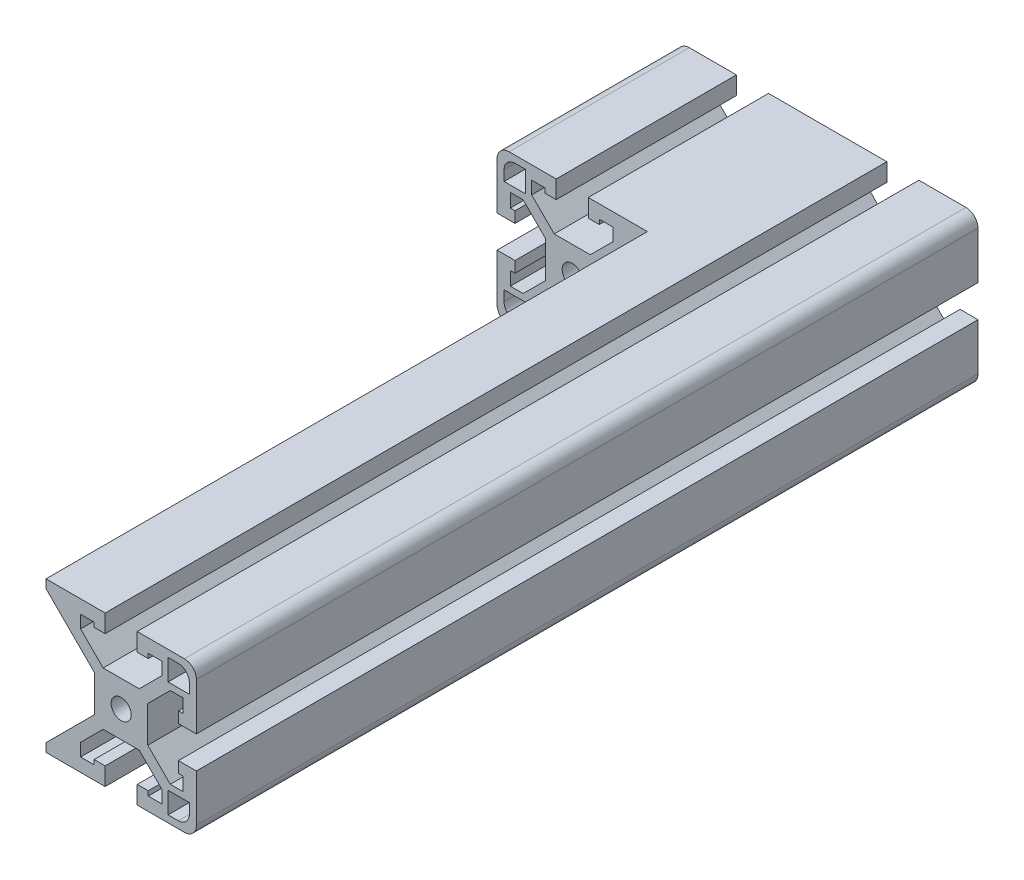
from build123d import *

# Parameters (mm, degrees)
SKETCH1_R           = 2.5527
BOSS_EXTRUDE1_DEPTH = 99.0346
SKETCH2_W           = 38.1
SKETCH2_H           = 38.1
CUT_EXTRUDE1_DEPTH  = 152.4


with BuildPart() as part:
    # Sketch1 → Boss-Extrude1 (new, symmetric)
    with BuildSketch(Plane.XY):
        with BuildLine():
            Line((-29.337, 12.442261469), (-29.337, 15.6718))
            Line((-29.337, 15.6718), (-25.908, 15.6718))
            Line((-25.908, 15.6718), (-25.908, 14.5034))
            Line((-25.908, 14.5034), (-23.114, 14.5034))
            Line((-23.114, 14.5034), (-23.114, 19.05))
            Line((-23.114, 19.05), (-35.052, 19.05))
            ThreePointArc((-35.052, 19.05), (-37.207261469, 18.157261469), (-38.1, 16.002))
            Line((-38.1, 16.002), (-38.1, 4.064))
            Line((-38.1, 4.064), (-33.5534, 4.064))
            Line((-33.5534, 4.064), (-33.5534, 6.858))
            Line((-33.5534, 6.858), (-34.7218, 6.858))
            Line((-34.7218, 6.858), (-34.7218, 10.287))
            Line((-34.7218, 10.287), (-31.492261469, 10.287))
            Line((-31.492261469, 10.287), (-25.781, 4.575738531))
            Line((-25.781, 4.575738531), (-25.781, -4.575738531))
            Line((-25.781, -4.575738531), (-31.492261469, -10.287))
            Line((-31.492261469, -10.287), (-34.7218, -10.287))
            Line((-34.7218, -10.287), (-34.7218, -6.858))
            Line((-34.7218, -6.858), (-33.5534, -6.858))
            Line((-33.5534, -6.858), (-33.5534, -4.064))
            Line((-33.5534, -4.064), (-38.1, -4.064))
            Line((-38.1, -4.064), (-38.1, -16.002))
            ThreePointArc((-38.1, -16.002), (-37.207261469, -18.157261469), (-35.052, -19.05))
            Line((-35.052, -19.05), (-23.114, -19.05))
            Line((-23.114, -19.05), (-23.114, -14.5034))
            Line((-23.114, -14.5034), (-25.908, -14.5034))
            Line((-25.908, -14.5034), (-25.908, -15.6718))
            Line((-25.908, -15.6718), (-29.337, -15.6718))
            Line((-29.337, -15.6718), (-29.337, -12.442261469))
            Line((-29.337, -12.442261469), (-23.625738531, -6.731))
            Line((-23.625738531, -6.731), (-14.474261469, -6.731))
            Line((-14.474261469, -6.731), (-8.763, -12.442261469))
            Line((-8.763, -12.442261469), (-8.763, -15.6718))
            Line((-8.763, -15.6718), (-12.192, -15.6718))
            Line((-12.192, -15.6718), (-12.192, -14.5034))
            Line((-12.192, -14.5034), (-14.986, -14.5034))
            Line((-14.986, -14.5034), (-14.986, -19.05))
            Line((-14.986, -19.05), (14.986, -19.05))
            Line((14.986, -19.05), (14.986, -14.5034))
            Line((14.986, -14.5034), (12.192, -14.5034))
            Line((12.192, -14.5034), (12.192, -15.6718))
            Line((12.192, -15.6718), (8.763, -15.6718))
            Line((8.763, -15.6718), (8.763, -12.442261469))
            Line((8.763, -12.442261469), (14.474261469, -6.731))
            Line((14.474261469, -6.731), (23.625738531, -6.731))
            Line((23.625738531, -6.731), (29.337, -12.442261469))
            Line((29.337, -12.442261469), (29.337, -15.6718))
            Line((29.337, -15.6718), (25.908, -15.6718))
            Line((25.908, -15.6718), (25.908, -14.5034))
            Line((25.908, -14.5034), (23.114, -14.5034))
            Line((23.114, -14.5034), (23.114, -19.05))
            Line((23.114, -19.05), (35.052, -19.05))
            ThreePointArc((35.052, -19.05), (37.207261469, -18.157261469), (38.1, -16.002))
            Line((38.1, -16.002), (38.1, -4.064))
            Line((38.1, -4.064), (33.5534, -4.064))
            Line((33.5534, -4.064), (33.5534, -6.858))
            Line((33.5534, -6.858), (34.7218, -6.858))
            Line((34.7218, -6.858), (34.7218, -10.287))
            Line((34.7218, -10.287), (31.492261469, -10.287))
            Line((31.492261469, -10.287), (25.781, -4.575738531))
            Line((25.781, -4.575738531), (25.781, 4.575738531))
            Line((25.781, 4.575738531), (31.492261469, 10.287))
            Line((31.492261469, 10.287), (34.7218, 10.287))
            Line((34.7218, 10.287), (34.7218, 6.858))
            Line((34.7218, 6.858), (33.5534, 6.858))
            Line((33.5534, 6.858), (33.5534, 4.064))
            Line((33.5534, 4.064), (38.1, 4.064))
            Line((38.1, 4.064), (38.1, 16.002))
            ThreePointArc((38.1, 16.002), (37.207261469, 18.157261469), (35.052, 19.05))
            Line((35.052, 19.05), (23.114, 19.05))
            Line((23.114, 19.05), (23.114, 14.5034))
            Line((23.114, 14.5034), (25.908, 14.5034))
            Line((25.908, 14.5034), (25.908, 15.6718))
            Line((25.908, 15.6718), (29.337, 15.6718))
            Line((29.337, 15.6718), (29.337, 12.442261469))
            Line((29.337, 12.442261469), (23.625738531, 6.731))
            Line((23.625738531, 6.731), (14.474261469, 6.731))
            Line((14.474261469, 6.731), (8.763, 12.442261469))
            Line((8.763, 12.442261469), (8.763, 15.6718))
            Line((8.763, 15.6718), (12.192, 15.6718))
            Line((12.192, 15.6718), (12.192, 14.5034))
            Line((12.192, 14.5034), (14.986, 14.5034))
            Line((14.986, 14.5034), (14.986, 19.05))
            Line((14.986, 19.05), (-14.986, 19.05))
            Line((-14.986, 19.05), (-14.986, 14.5034))
            Line((-14.986, 14.5034), (-12.192, 14.5034))
            Line((-12.192, 14.5034), (-12.192, 15.6718))
            Line((-12.192, 15.6718), (-8.763, 15.6718))
            Line((-8.763, 15.6718), (-8.763, 12.442261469))
            Line((-8.763, 12.442261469), (-14.474261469, 6.731))
            Line((-14.474261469, 6.731), (-23.625738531, 6.731))
            Line((-23.625738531, 6.731), (-29.337, 12.442261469))
        make_face()
        with Locations((-19.05, 0)):
            Circle(SKETCH1_R, mode=Mode.SUBTRACT)
        with Locations((19.05, 0)):
            Circle(SKETCH1_R, mode=Mode.SUBTRACT)
        Polygon((-12.319, 4.575738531), (-12.319, -4.575738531), (0, -16.894738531), (12.319, -4.575738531), (12.319, 4.575738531), (0, 16.894738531), align=None, mode=Mode.SUBTRACT)
        with BuildLine():
            Line((-30.9372, 11.8872), (-30.9372, 17.272))
            Line((-30.9372, 17.272), (-33.528, 17.272))
            ThreePointArc((-33.528, 17.272), (-35.503656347, 16.453656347), (-36.322, 14.478))
            Line((-36.322, 14.478), (-36.322, 11.8872))
            Line((-36.322, 11.8872), (-30.9372, 11.8872))
        make_face(mode=Mode.SUBTRACT)
        with BuildLine():
            Line((-30.9372, -17.272), (-30.9372, -11.8872))
            Line((-30.9372, -11.8872), (-36.322, -11.8872))
            Line((-36.322, -11.8872), (-36.322, -14.478))
            ThreePointArc((-36.322, -14.478), (-35.503656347, -16.453656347), (-33.528, -17.272))
            Line((-33.528, -17.272), (-30.9372, -17.272))
        make_face(mode=Mode.SUBTRACT)
        with BuildLine():
            Line((36.322, -11.8872), (30.9372, -11.8872))
            Line((30.9372, -11.8872), (30.9372, -17.272))
            Line((30.9372, -17.272), (33.528, -17.272))
            ThreePointArc((33.528, -17.272), (35.503656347, -16.453656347), (36.322, -14.478))
            Line((36.322, -14.478), (36.322, -11.8872))
        make_face(mode=Mode.SUBTRACT)
        with BuildLine():
            Line((30.9372, 17.272), (30.9372, 11.8872))
            Line((30.9372, 11.8872), (36.322, 11.8872))
            Line((36.322, 11.8872), (36.322, 14.478))
            ThreePointArc((36.322, 14.478), (35.503656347, 16.453656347), (33.528, 17.272))
            Line((33.528, 17.272), (30.9372, 17.272))
        make_face(mode=Mode.SUBTRACT)
    extrude(amount=BOSS_EXTRUDE1_DEPTH, both=True)

    # Sketch2 → Cut-Extrude1 (cut)
    with BuildSketch(Plane.XY.offset(99.0346)):
        with Locations((-19.05, 0)):
            Rectangle(SKETCH2_W, SKETCH2_H)
    extrude(amount=-CUT_EXTRUDE1_DEPTH, mode=Mode.SUBTRACT)


solid = part.part
